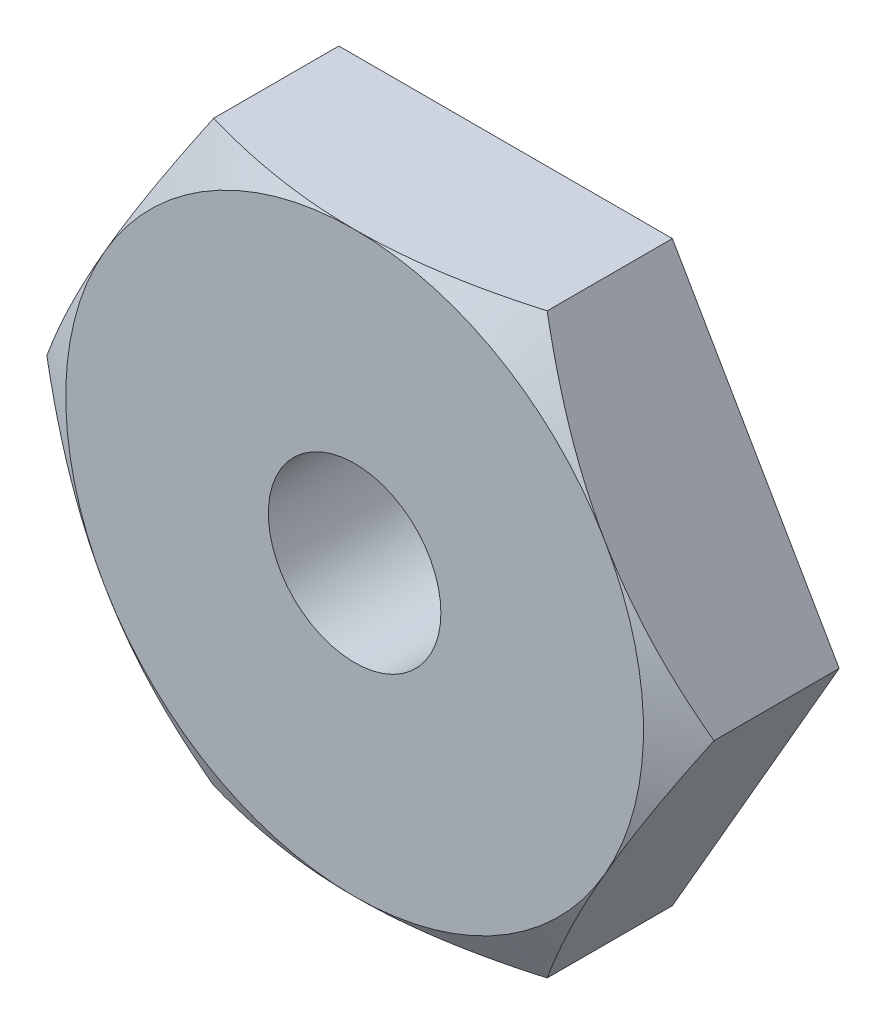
ISO-10303-21;
HEADER;
FILE_DESCRIPTION(('STEP AP214'),'2;1');
FILE_NAME('part.step','',(''),(''),'','','');
FILE_SCHEMA(('AUTOMOTIVE_DESIGN { 1 0 10303 214 1 1 1 1 }'));
ENDSEC;
DATA;
#1=APPLICATION_CONTEXT('core data for automotive mechanical design processes');
#2=APPLICATION_PROTOCOL_DEFINITION('international standard','automotive_design',2000,#1);
#3=PRODUCT_CONTEXT('',#1,'mechanical');
#4=PRODUCT('Part','Part','',(#3));
#5=PRODUCT_RELATED_PRODUCT_CATEGORY('part','',(#4));
#6=PRODUCT_DEFINITION_FORMATION('','',#4);
#7=PRODUCT_DEFINITION_CONTEXT('part definition',#1,'design');
#8=PRODUCT_DEFINITION('design','',#6,#7);
#9=PRODUCT_DEFINITION_SHAPE('','',#8);
#10=(LENGTH_UNIT() NAMED_UNIT(*) SI_UNIT(.MILLI.,.METRE.));
#11=(NAMED_UNIT(*) PLANE_ANGLE_UNIT() SI_UNIT($,.RADIAN.));
#12=(NAMED_UNIT(*) SI_UNIT($,.STERADIAN.) SOLID_ANGLE_UNIT());
#13=UNCERTAINTY_MEASURE_WITH_UNIT(LENGTH_MEASURE(1.E-05),#10,'distance_accuracy_value','');
#14=(GEOMETRIC_REPRESENTATION_CONTEXT(3) GLOBAL_UNCERTAINTY_ASSIGNED_CONTEXT((#13)) GLOBAL_UNIT_ASSIGNED_CONTEXT((#10,
#11,#12)) REPRESENTATION_CONTEXT('',''));
#15=CARTESIAN_POINT('',(0.,0.,0.));
#16=DIRECTION('',(0.,0.,1.));
#17=DIRECTION('',(1.,0.,0.));
#18=AXIS2_PLACEMENT_3D('',#15,#16,#17);
#19=CARTESIAN_POINT('',(-2.74963065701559,4.7625,2.4892));
#20=DIRECTION('',(0.,0.,-1.));
#21=DIRECTION('',(-1.,0.,0.));
#22=AXIS2_PLACEMENT_3D('',#19,#20,#21);
#23=PLANE('',#22);
#24=CARTESIAN_POINT('',(0.,0.,2.4892));
#25=DIRECTION('',(0.,0.,1.));
#26=DIRECTION('',(1.,0.,0.));
#27=AXIS2_PLACEMENT_3D('',#24,#25,#26);
#28=CIRCLE('',#27,1.4224);
#29=CARTESIAN_POINT('',(1.4224,0.,2.4892));
#30=VERTEX_POINT('',#29);
#31=EDGE_CURVE('E181',#30,#30,#28,.T.);
#32=ORIENTED_EDGE('',*,*,#31,.F.);
#33=EDGE_LOOP('',(#32));
#34=FACE_BOUND('',#33,.T.);
#35=CARTESIAN_POINT('',(0.,0.,2.4892));
#36=DIRECTION('',(0.,0.,1.));
#37=DIRECTION('',(1.,0.,0.));
#38=AXIS2_PLACEMENT_3D('',#35,#36,#37);
#39=CIRCLE('',#38,4.7625);
#40=CARTESIAN_POINT('',(0.,4.7625,2.4892));
#41=VERTEX_POINT('',#40);
#42=CARTESIAN_POINT('',(-4.12444598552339,2.38124999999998,2.4892));
#43=VERTEX_POINT('',#42);
#44=EDGE_CURVE('E154',#41,#43,#39,.T.);
#45=ORIENTED_EDGE('',*,*,#44,.T.);
#46=CARTESIAN_POINT('',(-4.12444598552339,-2.38124999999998,2.4892));
#47=VERTEX_POINT('',#46);
#48=EDGE_CURVE('E350',#43,#47,#39,.T.);
#49=ORIENTED_EDGE('',*,*,#48,.T.);
#50=CARTESIAN_POINT('',(0.,-4.7625,2.4892));
#51=VERTEX_POINT('',#50);
#52=EDGE_CURVE('E358',#47,#51,#39,.T.);
#53=ORIENTED_EDGE('',*,*,#52,.T.);
#54=CARTESIAN_POINT('',(4.12444598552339,-2.38124999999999,2.4892));
#55=VERTEX_POINT('',#54);
#56=EDGE_CURVE('E54',#51,#55,#39,.T.);
#57=ORIENTED_EDGE('',*,*,#56,.T.);
#58=CARTESIAN_POINT('',(4.12444598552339,2.38124999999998,2.4892));
#59=VERTEX_POINT('',#58);
#60=EDGE_CURVE('E62',#55,#59,#39,.T.);
#61=ORIENTED_EDGE('',*,*,#60,.T.);
#62=EDGE_CURVE('E359',#59,#41,#39,.T.);
#63=ORIENTED_EDGE('',*,*,#62,.T.);
#64=EDGE_LOOP('',(#45,#49,#53,#57,#61,#63));
#65=FACE_BOUND('',#64,.T.);
#66=ADVANCED_FACE('F32',(#34,#65),#23,.F.);
#67=CARTESIAN_POINT('',(-5.49926131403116,0.,2.4892));
#68=DIRECTION('',(0.86602540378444,-0.499999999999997,0.));
#69=DIRECTION('',(0.499999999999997,0.86602540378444,0.));
#70=AXIS2_PLACEMENT_3D('',#67,#68,#69);
#71=PLANE('',#70);
#72=CARTESIAN_POINT('',(-2.74951518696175,4.7627,2.06376398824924));
#73=CARTESIAN_POINT('',(-2.8703530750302,4.55340263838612,2.13354638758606));
#74=CARTESIAN_POINT('',(-2.99222449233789,4.34231515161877,2.19701673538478));
#75=CARTESIAN_POINT('',(-3.23807763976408,3.91648500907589,2.30780480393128));
#76=CARTESIAN_POINT('',(-3.36206373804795,3.701734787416,2.35508333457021));
#77=CARTESIAN_POINT('',(-3.60851825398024,3.27486304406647,2.42866647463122));
#78=CARTESIAN_POINT('',(-3.73094828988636,3.06280800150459,2.45546120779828));
#79=CARTESIAN_POINT('',(-3.91502401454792,2.7439794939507,2.47948887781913));
#80=CARTESIAN_POINT('',(-3.97642458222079,2.63763059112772,2.48480535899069));
#81=CARTESIAN_POINT('',(-4.09928246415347,2.42483449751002,2.4899598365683));
#82=CARTESIAN_POINT('',(-4.16073977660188,2.31838730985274,2.4897980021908));
#83=CARTESIAN_POINT('',(-4.32911636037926,2.02675051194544,2.4818150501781));
#84=CARTESIAN_POINT('',(-4.43597984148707,1.84165753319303,2.46840757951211));
#85=CARTESIAN_POINT('',(-4.6489975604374,1.47270002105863,2.42589213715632));
#86=CARTESIAN_POINT('',(-4.75515104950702,1.28883678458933,2.39676963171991));
#87=CARTESIAN_POINT('',(-4.96859796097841,0.919135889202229,2.32397074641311));
#88=CARTESIAN_POINT('',(-5.07586444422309,0.733344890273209,2.27998588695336));
#89=CARTESIAN_POINT('',(-5.28879766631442,0.364533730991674,2.18015772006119));
#90=CARTESIAN_POINT('',(-5.39446713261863,0.181508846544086,2.12433786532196));
#91=CARTESIAN_POINT('',(-5.499376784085,-0.000200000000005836,2.06376398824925));
#92=B_SPLINE_CURVE_WITH_KNOTS('',3,(#72,#73,#74,#75,#76,#77,#78,#79,#80,#81,#82,#83,#84,#85,#86,
#87,#88,#89,#90,#91),.UNSPECIFIED.,.F.,.F.,(4,2,2,2,2,2,2,2,2,4),(0.,0.754910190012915,
1.51163483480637,2.24963134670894,2.61827336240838,2.98690399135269,3.62867423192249,
4.27103902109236,4.92765153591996,5.58297484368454),.UNSPECIFIED.);
#93=CARTESIAN_POINT('',(-2.74963065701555,4.7625,2.06383065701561));
#94=VERTEX_POINT('',#93);
#95=EDGE_CURVE('E151',#94,#43,#92,.T.);
#96=ORIENTED_EDGE('',*,*,#95,.F.);
#97=DIRECTION('',(0.,0.,-1.));
#98=VECTOR('',#97,1.);
#99=CARTESIAN_POINT('',(-2.74963065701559,4.7625,2.4892));
#100=LINE('',#99,#98);
#101=CARTESIAN_POINT('',(-2.74963065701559,4.7625,0.));
#102=VERTEX_POINT('',#101);
#103=EDGE_CURVE('E135',#94,#102,#100,.T.);
#104=ORIENTED_EDGE('',*,*,#103,.T.);
#105=DIRECTION('',(-0.499999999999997,-0.86602540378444,0.));
#106=VECTOR('',#105,1.);
#107=CARTESIAN_POINT('',(-5.49926131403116,0.,0.));
#108=LINE('',#107,#106);
#109=CARTESIAN_POINT('',(-5.49926131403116,0.,0.));
#110=VERTEX_POINT('',#109);
#111=EDGE_CURVE('E179',#102,#110,#108,.T.);
#112=ORIENTED_EDGE('',*,*,#111,.T.);
#113=DIRECTION('',(0.,0.,-1.));
#114=VECTOR('',#113,1.);
#115=CARTESIAN_POINT('',(-5.49926131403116,0.,2.4892));
#116=LINE('',#115,#114);
#117=CARTESIAN_POINT('',(-5.49926131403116,0.,2.06383065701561));
#118=VERTEX_POINT('',#117);
#119=EDGE_CURVE('E139',#118,#110,#116,.T.);
#120=ORIENTED_EDGE('',*,*,#119,.F.);
#121=EDGE_CURVE('E162',#43,#118,#92,.T.);
#122=ORIENTED_EDGE('',*,*,#121,.F.);
#123=EDGE_LOOP('',(#96,#104,#112,#120,#122));
#124=FACE_BOUND('',#123,.T.);
#125=ADVANCED_FACE('F34',(#124),#71,.F.);
#126=CARTESIAN_POINT('',(-2.74963065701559,-4.7625,2.4892));
#127=DIRECTION('',(0.86602540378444,0.499999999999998,0.));
#128=DIRECTION('',(-0.499999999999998,0.86602540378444,0.));
#129=AXIS2_PLACEMENT_3D('',#126,#127,#128);
#130=PLANE('',#129);
#131=CARTESIAN_POINT('',(-5.499376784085,0.000199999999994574,2.06376398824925));
#132=CARTESIAN_POINT('',(-5.37853889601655,-0.209097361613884,2.13354638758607));
#133=CARTESIAN_POINT('',(-5.25666747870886,-0.420184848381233,2.19701673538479));
#134=CARTESIAN_POINT('',(-5.01081433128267,-0.846014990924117,2.30780480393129));
#135=CARTESIAN_POINT('',(-4.8868282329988,-1.06076521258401,2.35508333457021));
#136=CARTESIAN_POINT('',(-4.64037371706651,-1.48763695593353,2.42866647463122));
#137=CARTESIAN_POINT('',(-4.51794368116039,-1.69969199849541,2.45546120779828));
#138=CARTESIAN_POINT('',(-4.33386795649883,-2.0185205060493,2.47948887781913));
#139=CARTESIAN_POINT('',(-4.27246738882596,-2.12486940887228,2.48480535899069));
#140=CARTESIAN_POINT('',(-4.14960950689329,-2.33766550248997,2.4899598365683));
#141=CARTESIAN_POINT('',(-4.08815219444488,-2.44411269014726,2.4897980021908));
#142=CARTESIAN_POINT('',(-3.9197756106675,-2.73574948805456,2.48181505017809));
#143=CARTESIAN_POINT('',(-3.81291212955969,-2.92084246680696,2.46840757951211));
#144=CARTESIAN_POINT('',(-3.59989441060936,-3.28979997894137,2.42589213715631));
#145=CARTESIAN_POINT('',(-3.49374092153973,-3.47366321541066,2.3967696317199));
#146=CARTESIAN_POINT('',(-3.28029401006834,-3.84336411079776,2.3239707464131));
#147=CARTESIAN_POINT('',(-3.17302752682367,-4.02915510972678,2.27998588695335));
#148=CARTESIAN_POINT('',(-2.96009430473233,-4.39796626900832,2.18015772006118));
#149=CARTESIAN_POINT('',(-2.85442483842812,-4.58099115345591,2.12433786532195));
#150=CARTESIAN_POINT('',(-2.74951518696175,-4.7627,2.06376398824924));
#151=B_SPLINE_CURVE_WITH_KNOTS('',3,(#131,#132,#133,#134,#135,#136,#137,#138,#139,#140,#141,
#142,#143,#144,#145,#146,#147,#148,#149,#150),.UNSPECIFIED.,.F.,.F.,(4,2,2,2,2,2,2,2,2,4),(0.,
0.754910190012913,1.51163483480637,2.24963134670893,2.61827336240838,2.98690399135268,
3.62867423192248,4.27103902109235,4.92765153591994,5.58297484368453),.UNSPECIFIED.);
#152=EDGE_CURVE('E190',#118,#47,#151,.T.);
#153=ORIENTED_EDGE('',*,*,#152,.F.);
#154=ORIENTED_EDGE('',*,*,#119,.T.);
#155=DIRECTION('',(0.499999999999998,-0.86602540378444,0.));
#156=VECTOR('',#155,1.);
#157=CARTESIAN_POINT('',(-2.74963065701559,-4.7625,0.));
#158=LINE('',#157,#156);
#159=CARTESIAN_POINT('',(-2.74963065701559,-4.7625,0.));
#160=VERTEX_POINT('',#159);
#161=EDGE_CURVE('E177',#110,#160,#158,.T.);
#162=ORIENTED_EDGE('',*,*,#161,.T.);
#163=DIRECTION('',(0.,0.,-1.));
#164=VECTOR('',#163,1.);
#165=CARTESIAN_POINT('',(-2.74963065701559,-4.7625,2.4892));
#166=LINE('',#165,#164);
#167=CARTESIAN_POINT('',(-2.74963065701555,-4.7625,2.06383065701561));
#168=VERTEX_POINT('',#167);
#169=EDGE_CURVE('E133',#168,#160,#166,.T.);
#170=ORIENTED_EDGE('',*,*,#169,.F.);
#171=EDGE_CURVE('E191',#47,#168,#151,.T.);
#172=ORIENTED_EDGE('',*,*,#171,.F.);
#173=EDGE_LOOP('',(#153,#154,#162,#170,#172));
#174=FACE_BOUND('',#173,.T.);
#175=ADVANCED_FACE('F230',(#174),#130,.F.);
#176=CARTESIAN_POINT('',(2.74963065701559,-4.7625,2.4892));
#177=DIRECTION('',(0.,1.,0.));
#178=DIRECTION('',(0.,0.,1.));
#179=AXIS2_PLACEMENT_3D('',#176,#177,#178);
#180=PLANE('',#179);
#181=CARTESIAN_POINT('',(-7.29242571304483,-4.7625,0.21021656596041));
#182=CARTESIAN_POINT('',(-7.08332503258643,-4.7625,0.311265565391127));
#183=CARTESIAN_POINT('',(-6.87372996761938,-4.7625,0.411310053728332));
#184=CARTESIAN_POINT('',(-6.45328375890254,-4.7625,0.608815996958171));
#185=CARTESIAN_POINT('',(-6.24243240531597,-4.7625,0.706277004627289));
#186=CARTESIAN_POINT('',(-5.81806730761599,-4.7625,0.898555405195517));
#187=CARTESIAN_POINT('',(-5.60454523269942,-4.7625,0.99335447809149));
#188=CARTESIAN_POINT('',(-5.1757461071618,-4.7625,1.17888077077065));
#189=CARTESIAN_POINT('',(-4.96046914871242,-4.7625,1.26960820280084));
#190=CARTESIAN_POINT('',(-4.52514542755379,-4.7625,1.44698563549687));
#191=CARTESIAN_POINT('',(-4.30507255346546,-4.7625,1.53357190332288));
#192=CARTESIAN_POINT('',(-3.86233085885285,-4.7625,1.6999629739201));
#193=CARTESIAN_POINT('',(-3.63966175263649,-4.7625,1.77976702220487));
#194=CARTESIAN_POINT('',(-3.19183146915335,-4.7625,1.93044956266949));
#195=CARTESIAN_POINT('',(-2.96667674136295,-4.7625,2.0013470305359));
#196=CARTESIAN_POINT('',(-2.51316408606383,-4.7625,2.13191306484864));
#197=CARTESIAN_POINT('',(-2.28480719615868,-4.7625,2.1915851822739));
#198=CARTESIAN_POINT('',(-1.82474524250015,-4.7625,2.2968066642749));
#199=CARTESIAN_POINT('',(-1.59303930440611,-4.7625,2.34235226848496));
#200=CARTESIAN_POINT('',(-1.12680140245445,-4.7625,2.41624273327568));
#201=CARTESIAN_POINT('',(-0.892269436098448,-4.7625,2.4445875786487));
#202=CARTESIAN_POINT('',(-0.54009824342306,-4.7625,2.47238723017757));
#203=CARTESIAN_POINT('',(-0.423010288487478,-4.7625,2.47920225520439));
#204=CARTESIAN_POINT('',(-0.188645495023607,-4.7625,2.48787083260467));
#205=CARTESIAN_POINT('',(-0.0713686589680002,-4.7625,2.48972444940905));
#206=CARTESIAN_POINT('',(0.163123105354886,-4.7625,2.48842040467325));
#207=CARTESIAN_POINT('',(0.280338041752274,-4.7625,2.48526415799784));
#208=CARTESIAN_POINT('',(0.514533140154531,-4.7625,2.47402042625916));
#209=CARTESIAN_POINT('',(0.631513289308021,-4.7625,2.46593267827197));
#210=CARTESIAN_POINT('',(0.915050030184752,-4.7625,2.44052110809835));
#211=CARTESIAN_POINT('',(1.08138937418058,-4.7625,2.4207254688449));
#212=CARTESIAN_POINT('',(1.41276151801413,-4.7625,2.37226600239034));
#213=CARTESIAN_POINT('',(1.57779414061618,-4.7625,2.34360099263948));
#214=CARTESIAN_POINT('',(2.07083902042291,-4.7625,2.24581689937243));
#215=CARTESIAN_POINT('',(2.39654516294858,-4.7625,2.16493434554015));
#216=CARTESIAN_POINT('',(2.88391142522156,-4.7625,2.0254322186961));
#217=CARTESIAN_POINT('',(3.0481136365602,-4.7625,1.97519062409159));
#218=CARTESIAN_POINT('',(3.37480455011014,-4.7625,1.86973613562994));
#219=CARTESIAN_POINT('',(3.53729434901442,-4.7625,1.81452667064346));
#220=CARTESIAN_POINT('',(3.85988055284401,-4.7625,1.70028509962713));
#221=CARTESIAN_POINT('',(4.01998528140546,-4.7625,1.6412762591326));
#222=CARTESIAN_POINT('',(4.33895253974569,-4.7625,1.51979507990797));
#223=CARTESIAN_POINT('',(4.4978145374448,-4.7625,1.45732134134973));
#224=CARTESIAN_POINT('',(4.6561021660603,-4.7625,1.39345708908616));
#225=B_SPLINE_CURVE_WITH_KNOTS('',3,(#181,#182,#183,#184,#185,#186,#187,#188,#189,#190,#191,
#192,#193,#194,#195,#196,#197,#198,#199,#200,#201,#202,#203,#204,#205,#206,#207,#208,#209,#210,
#211,#212,#213,#214,#215,#216,#217,#218,#219,#220,#221,#222,#223,#224),.UNSPECIFIED.,.F.,.F.,(4,
2,2,2,2,2,2,2,2,2,2,2,2,2,2,2,2,2,2,2,2,4),(0.,0.696720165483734,1.39356016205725,
2.09438789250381,2.79517904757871,3.50457374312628,4.21404725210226,4.92198260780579,
5.62969364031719,6.33759289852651,7.04549278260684,7.39726182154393,7.74902629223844,
8.10069143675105,8.45237533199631,8.95462912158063,9.45694990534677,10.4623513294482,
10.9774608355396,11.4922174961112,12.0040767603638,12.5161443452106),.UNSPECIFIED.);
#226=EDGE_CURVE('E226',#168,#51,#225,.T.);
#227=ORIENTED_EDGE('',*,*,#226,.F.);
#228=ORIENTED_EDGE('',*,*,#169,.T.);
#229=DIRECTION('',(1.,0.,0.));
#230=VECTOR('',#229,1.);
#231=CARTESIAN_POINT('',(2.74963065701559,-4.7625,0.));
#232=LINE('',#231,#230);
#233=CARTESIAN_POINT('',(2.74963065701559,-4.7625,0.));
#234=VERTEX_POINT('',#233);
#235=EDGE_CURVE('E174',#160,#234,#232,.T.);
#236=ORIENTED_EDGE('',*,*,#235,.T.);
#237=DIRECTION('',(0.,0.,-1.));
#238=VECTOR('',#237,1.);
#239=CARTESIAN_POINT('',(2.74963065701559,-4.7625,2.4892));
#240=LINE('',#239,#238);
#241=CARTESIAN_POINT('',(2.74963065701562,-4.76249999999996,2.06383065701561));
#242=VERTEX_POINT('',#241);
#243=EDGE_CURVE('E130',#242,#234,#240,.T.);
#244=ORIENTED_EDGE('',*,*,#243,.F.);
#245=EDGE_CURVE('E220',#51,#242,#225,.T.);
#246=ORIENTED_EDGE('',*,*,#245,.F.);
#247=EDGE_LOOP('',(#227,#228,#236,#244,#246));
#248=FACE_BOUND('',#247,.T.);
#249=ADVANCED_FACE('F227',(#248),#180,.F.);
#250=CARTESIAN_POINT('',(5.49926131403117,0.,2.4892));
#251=DIRECTION('',(-0.86602540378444,0.499999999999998,0.));
#252=DIRECTION('',(-0.499999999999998,-0.86602540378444,0.));
#253=AXIS2_PLACEMENT_3D('',#250,#251,#252);
#254=PLANE('',#253);
#255=CARTESIAN_POINT('',(2.74951518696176,-4.7627,2.06376398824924));
#256=CARTESIAN_POINT('',(2.87035307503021,-4.55340263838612,2.13354638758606));
#257=CARTESIAN_POINT('',(2.9922244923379,-4.34231515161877,2.19701673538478));
#258=CARTESIAN_POINT('',(3.23807763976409,-3.91648500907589,2.30780480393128));
#259=CARTESIAN_POINT('',(3.36206373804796,-3.701734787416,2.35508333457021));
#260=CARTESIAN_POINT('',(3.60851825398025,-3.27486304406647,2.42866647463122));
#261=CARTESIAN_POINT('',(3.73094828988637,-3.06280800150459,2.45546120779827));
#262=CARTESIAN_POINT('',(3.91502401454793,-2.7439794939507,2.47948887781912));
#263=CARTESIAN_POINT('',(3.9764245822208,-2.63763059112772,2.48480535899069));
#264=CARTESIAN_POINT('',(4.09928246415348,-2.42483449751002,2.4899598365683));
#265=CARTESIAN_POINT('',(4.16073977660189,-2.31838730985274,2.4897980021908));
#266=CARTESIAN_POINT('',(4.32911636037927,-2.02675051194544,2.48181505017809));
#267=CARTESIAN_POINT('',(4.43597984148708,-1.84165753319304,2.46840757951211));
#268=CARTESIAN_POINT('',(4.64899756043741,-1.47270002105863,2.42589213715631));
#269=CARTESIAN_POINT('',(4.75515104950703,-1.28883678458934,2.39676963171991));
#270=CARTESIAN_POINT('',(4.96859796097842,-0.919135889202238,2.32397074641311));
#271=CARTESIAN_POINT('',(5.0758644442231,-0.733344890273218,2.27998588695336));
#272=CARTESIAN_POINT('',(5.28879766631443,-0.364533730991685,2.18015772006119));
#273=CARTESIAN_POINT('',(5.39446713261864,-0.181508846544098,2.12433786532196));
#274=CARTESIAN_POINT('',(5.49937678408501,0.000199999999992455,2.06376398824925));
#275=B_SPLINE_CURVE_WITH_KNOTS('',3,(#255,#256,#257,#258,#259,#260,#261,#262,#263,#264,#265,
#266,#267,#268,#269,#270,#271,#272,#273,#274),.UNSPECIFIED.,.F.,.F.,(4,2,2,2,2,2,2,2,2,4),(0.,
0.754910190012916,1.51163483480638,2.24963134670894,2.61827336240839,2.98690399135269,
3.62867423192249,4.27103902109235,4.92765153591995,5.58297484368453),.UNSPECIFIED.);
#276=EDGE_CURVE('E116',#242,#55,#275,.T.);
#277=ORIENTED_EDGE('',*,*,#276,.F.);
#278=ORIENTED_EDGE('',*,*,#243,.T.);
#279=DIRECTION('',(0.499999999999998,0.86602540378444,0.));
#280=VECTOR('',#279,1.);
#281=CARTESIAN_POINT('',(5.49926131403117,0.,0.));
#282=LINE('',#281,#280);
#283=CARTESIAN_POINT('',(5.49926131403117,0.,0.));
#284=VERTEX_POINT('',#283);
#285=EDGE_CURVE('E128',#234,#284,#282,.T.);
#286=ORIENTED_EDGE('',*,*,#285,.T.);
#287=DIRECTION('',(0.,0.,-1.));
#288=VECTOR('',#287,1.);
#289=CARTESIAN_POINT('',(5.49926131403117,0.,2.4892));
#290=LINE('',#289,#288);
#291=CARTESIAN_POINT('',(5.49926131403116,0.,2.06383065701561));
#292=VERTEX_POINT('',#291);
#293=EDGE_CURVE('E121',#292,#284,#290,.T.);
#294=ORIENTED_EDGE('',*,*,#293,.F.);
#295=EDGE_CURVE('E108',#55,#292,#275,.T.);
#296=ORIENTED_EDGE('',*,*,#295,.F.);
#297=EDGE_LOOP('',(#277,#278,#286,#294,#296));
#298=FACE_BOUND('',#297,.T.);
#299=ADVANCED_FACE('F126',(#298),#254,.F.);
#300=CARTESIAN_POINT('',(2.74963065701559,4.7625,2.4892));
#301=DIRECTION('',(-0.86602540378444,-0.499999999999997,0.));
#302=DIRECTION('',(0.499999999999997,-0.86602540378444,0.));
#303=AXIS2_PLACEMENT_3D('',#300,#301,#302);
#304=PLANE('',#303);
#305=CARTESIAN_POINT('',(5.49937678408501,-0.000200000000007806,2.06376398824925));
#306=CARTESIAN_POINT('',(5.37853889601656,0.209097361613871,2.13354638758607));
#307=CARTESIAN_POINT('',(5.25666747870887,0.42018484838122,2.19701673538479));
#308=CARTESIAN_POINT('',(5.01081433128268,0.846014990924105,2.30780480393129));
#309=CARTESIAN_POINT('',(4.88682823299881,1.06076521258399,2.35508333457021));
#310=CARTESIAN_POINT('',(4.64037371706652,1.48763695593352,2.42866647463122));
#311=CARTESIAN_POINT('',(4.5179436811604,1.6996919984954,2.45546120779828));
#312=CARTESIAN_POINT('',(4.33386795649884,2.01852050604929,2.47948887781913));
#313=CARTESIAN_POINT('',(4.27246738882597,2.12486940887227,2.48480535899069));
#314=CARTESIAN_POINT('',(4.14960950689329,2.33766550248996,2.4899598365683));
#315=CARTESIAN_POINT('',(4.08815219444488,2.44411269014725,2.4897980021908));
#316=CARTESIAN_POINT('',(3.9197756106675,2.73574948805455,2.48181505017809));
#317=CARTESIAN_POINT('',(3.81291212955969,2.92084246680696,2.46840757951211));
#318=CARTESIAN_POINT('',(3.59989441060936,3.28979997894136,2.42589213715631));
#319=CARTESIAN_POINT('',(3.49374092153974,3.47366321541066,2.3967696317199));
#320=CARTESIAN_POINT('',(3.28029401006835,3.84336411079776,2.3239707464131));
#321=CARTESIAN_POINT('',(3.17302752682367,4.02915510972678,2.27998588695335));
#322=CARTESIAN_POINT('',(2.96009430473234,4.39796626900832,2.18015772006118));
#323=CARTESIAN_POINT('',(2.85442483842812,4.58099115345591,2.12433786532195));
#324=CARTESIAN_POINT('',(2.74951518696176,4.7627,2.06376398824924));
#325=B_SPLINE_CURVE_WITH_KNOTS('',3,(#305,#306,#307,#308,#309,#310,#311,#312,#313,#314,#315,
#316,#317,#318,#319,#320,#321,#322,#323,#324),.UNSPECIFIED.,.F.,.F.,(4,2,2,2,2,2,2,2,2,4),(0.,
0.754910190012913,1.51163483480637,2.24963134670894,2.61827336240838,2.98690399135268,
3.62867423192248,4.27103902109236,4.92765153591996,5.58297484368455),.UNSPECIFIED.);
#326=EDGE_CURVE('E111',#292,#59,#325,.T.);
#327=ORIENTED_EDGE('',*,*,#326,.F.);
#328=ORIENTED_EDGE('',*,*,#293,.T.);
#329=DIRECTION('',(-0.499999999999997,0.86602540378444,0.));
#330=VECTOR('',#329,1.);
#331=CARTESIAN_POINT('',(2.74963065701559,4.7625,0.));
#332=LINE('',#331,#330);
#333=CARTESIAN_POINT('',(2.74963065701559,4.7625,0.));
#334=VERTEX_POINT('',#333);
#335=EDGE_CURVE('E169',#284,#334,#332,.T.);
#336=ORIENTED_EDGE('',*,*,#335,.T.);
#337=DIRECTION('',(0.,0.,-1.));
#338=VECTOR('',#337,1.);
#339=CARTESIAN_POINT('',(2.74963065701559,4.7625,2.4892));
#340=LINE('',#339,#338);
#341=CARTESIAN_POINT('',(2.74963065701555,4.7625,2.06383065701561));
#342=VERTEX_POINT('',#341);
#343=EDGE_CURVE('E131',#342,#334,#340,.T.);
#344=ORIENTED_EDGE('',*,*,#343,.F.);
#345=EDGE_CURVE('E124',#59,#342,#325,.T.);
#346=ORIENTED_EDGE('',*,*,#345,.F.);
#347=EDGE_LOOP('',(#327,#328,#336,#344,#346));
#348=FACE_BOUND('',#347,.T.);
#349=ADVANCED_FACE('F119',(#348),#304,.F.);
#350=CARTESIAN_POINT('',(-2.74963065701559,4.7625,2.4892));
#351=DIRECTION('',(0.,-1.,0.));
#352=DIRECTION('',(0.,0.,-1.));
#353=AXIS2_PLACEMENT_3D('',#350,#351,#352);
#354=PLANE('',#353);
#355=CARTESIAN_POINT('',(-7.29242571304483,4.7625,0.210216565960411));
#356=CARTESIAN_POINT('',(-7.08332503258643,4.7625,0.311265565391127));
#357=CARTESIAN_POINT('',(-6.87372996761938,4.7625,0.411310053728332));
#358=CARTESIAN_POINT('',(-6.45328375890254,4.7625,0.608815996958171));
#359=CARTESIAN_POINT('',(-6.24243240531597,4.7625,0.706277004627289));
#360=CARTESIAN_POINT('',(-5.81806730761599,4.7625,0.898555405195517));
#361=CARTESIAN_POINT('',(-5.60454523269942,4.7625,0.993354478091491));
#362=CARTESIAN_POINT('',(-5.1757461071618,4.7625,1.17888077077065));
#363=CARTESIAN_POINT('',(-4.96046914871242,4.7625,1.26960820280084));
#364=CARTESIAN_POINT('',(-4.52514542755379,4.7625,1.44698563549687));
#365=CARTESIAN_POINT('',(-4.30507255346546,4.7625,1.53357190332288));
#366=CARTESIAN_POINT('',(-3.86233085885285,4.7625,1.6999629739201));
#367=CARTESIAN_POINT('',(-3.63966175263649,4.7625,1.77976702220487));
#368=CARTESIAN_POINT('',(-3.19183146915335,4.7625,1.93044956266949));
#369=CARTESIAN_POINT('',(-2.96667674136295,4.7625,2.0013470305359));
#370=CARTESIAN_POINT('',(-2.51316408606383,4.7625,2.13191306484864));
#371=CARTESIAN_POINT('',(-2.28480719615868,4.7625,2.1915851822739));
#372=CARTESIAN_POINT('',(-1.82474524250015,4.7625,2.2968066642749));
#373=CARTESIAN_POINT('',(-1.59303930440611,4.7625,2.34235226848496));
#374=CARTESIAN_POINT('',(-1.12680140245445,4.7625,2.41624273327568));
#375=CARTESIAN_POINT('',(-0.892269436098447,4.7625,2.4445875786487));
#376=CARTESIAN_POINT('',(-0.54009824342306,4.7625,2.47238723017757));
#377=CARTESIAN_POINT('',(-0.423010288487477,4.7625,2.47920225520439));
#378=CARTESIAN_POINT('',(-0.188645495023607,4.7625,2.48787083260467));
#379=CARTESIAN_POINT('',(-0.0713686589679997,4.7625,2.48972444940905));
#380=CARTESIAN_POINT('',(0.163123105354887,4.7625,2.48842040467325));
#381=CARTESIAN_POINT('',(0.280338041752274,4.7625,2.48526415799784));
#382=CARTESIAN_POINT('',(0.514533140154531,4.7625,2.47402042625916));
#383=CARTESIAN_POINT('',(0.631513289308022,4.7625,2.46593267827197));
#384=CARTESIAN_POINT('',(0.915050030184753,4.7625,2.44052110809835));
#385=CARTESIAN_POINT('',(1.08138937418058,4.7625,2.4207254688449));
#386=CARTESIAN_POINT('',(1.41276151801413,4.7625,2.37226600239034));
#387=CARTESIAN_POINT('',(1.57779414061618,4.7625,2.34360099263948));
#388=CARTESIAN_POINT('',(2.07083902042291,4.7625,2.24581689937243));
#389=CARTESIAN_POINT('',(2.39654516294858,4.7625,2.16493434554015));
#390=CARTESIAN_POINT('',(2.88391142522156,4.7625,2.0254322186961));
#391=CARTESIAN_POINT('',(3.0481136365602,4.7625,1.97519062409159));
#392=CARTESIAN_POINT('',(3.37480455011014,4.7625,1.86973613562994));
#393=CARTESIAN_POINT('',(3.53729434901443,4.7625,1.81452667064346));
#394=CARTESIAN_POINT('',(3.85988055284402,4.7625,1.70028509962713));
#395=CARTESIAN_POINT('',(4.01998528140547,4.7625,1.6412762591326));
#396=CARTESIAN_POINT('',(4.33895253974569,4.7625,1.51979507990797));
#397=CARTESIAN_POINT('',(4.4978145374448,4.7625,1.45732134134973));
#398=CARTESIAN_POINT('',(4.6561021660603,4.7625,1.39345708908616));
#399=B_SPLINE_CURVE_WITH_KNOTS('',3,(#355,#356,#357,#358,#359,#360,#361,#362,#363,#364,#365,
#366,#367,#368,#369,#370,#371,#372,#373,#374,#375,#376,#377,#378,#379,#380,#381,#382,#383,#384,
#385,#386,#387,#388,#389,#390,#391,#392,#393,#394,#395,#396,#397,#398),.UNSPECIFIED.,.F.,.F.,(4,
2,2,2,2,2,2,2,2,2,2,2,2,2,2,2,2,2,2,2,2,4),(0.,0.696720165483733,1.39356016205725,
2.09438789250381,2.79517904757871,3.50457374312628,4.21404725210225,4.92198260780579,
5.62969364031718,6.33759289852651,7.04549278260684,7.39726182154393,7.74902629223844,
8.10069143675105,8.4523753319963,8.95462912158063,9.45694990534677,10.4623513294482,
10.9774608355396,11.4922174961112,12.0040767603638,12.5161443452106),.UNSPECIFIED.);
#400=EDGE_CURVE('E11',#342,#41,#399,.F.);
#401=ORIENTED_EDGE('',*,*,#400,.F.);
#402=ORIENTED_EDGE('',*,*,#343,.T.);
#403=DIRECTION('',(-1.,0.,0.));
#404=VECTOR('',#403,1.);
#405=CARTESIAN_POINT('',(-2.74963065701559,4.7625,0.));
#406=LINE('',#405,#404);
#407=EDGE_CURVE('E167',#334,#102,#406,.T.);
#408=ORIENTED_EDGE('',*,*,#407,.T.);
#409=ORIENTED_EDGE('',*,*,#103,.F.);
#410=EDGE_CURVE('E37',#41,#94,#399,.F.);
#411=ORIENTED_EDGE('',*,*,#410,.F.);
#412=EDGE_LOOP('',(#401,#402,#408,#409,#411));
#413=FACE_BOUND('',#412,.T.);
#414=ADVANCED_FACE('F165',(#413),#354,.F.);
#415=CARTESIAN_POINT('',(-2.74963065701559,4.7625,0.));
#416=DIRECTION('',(0.,0.,-1.));
#417=DIRECTION('',(-1.,0.,0.));
#418=AXIS2_PLACEMENT_3D('',#415,#416,#417);
#419=PLANE('',#418);
#420=ORIENTED_EDGE('',*,*,#111,.F.);
#421=ORIENTED_EDGE('',*,*,#407,.F.);
#422=ORIENTED_EDGE('',*,*,#335,.F.);
#423=ORIENTED_EDGE('',*,*,#285,.F.);
#424=ORIENTED_EDGE('',*,*,#235,.F.);
#425=ORIENTED_EDGE('',*,*,#161,.F.);
#426=EDGE_LOOP('',(#420,#421,#422,#423,#424,#425));
#427=FACE_BOUND('',#426,.T.);
#428=CARTESIAN_POINT('',(0.,0.,0.));
#429=DIRECTION('',(0.,0.,1.));
#430=DIRECTION('',(1.,0.,0.));
#431=AXIS2_PLACEMENT_3D('',#428,#429,#430);
#432=CIRCLE('',#431,1.4224);
#433=CARTESIAN_POINT('',(1.4224,0.,0.));
#434=VERTEX_POINT('',#433);
#435=EDGE_CURVE('E163',#434,#434,#432,.T.);
#436=ORIENTED_EDGE('',*,*,#435,.T.);
#437=EDGE_LOOP('',(#436));
#438=FACE_BOUND('',#437,.T.);
#439=ADVANCED_FACE('F245',(#427,#438),#419,.T.);
#440=CARTESIAN_POINT('',(0.,0.,2.4892));
#441=DIRECTION('',(0.,0.,-1.));
#442=DIRECTION('',(-1.,0.,0.));
#443=AXIS2_PLACEMENT_3D('',#440,#441,#442);
#444=CYLINDRICAL_SURFACE('',#443,1.4224);
#445=ORIENTED_EDGE('',*,*,#31,.T.);
#446=EDGE_LOOP('',(#445));
#447=FACE_BOUND('',#446,.T.);
#448=ORIENTED_EDGE('',*,*,#435,.F.);
#449=EDGE_LOOP('',(#448));
#450=FACE_BOUND('',#449,.T.);
#451=ADVANCED_FACE('F201',(#447,#450),#444,.F.);
#452=CARTESIAN_POINT('',(0.,0.,2.4892));
#453=DIRECTION('',(0.,0.,-1.));
#454=DIRECTION('',(-1.,0.,0.));
#455=AXIS2_PLACEMENT_3D('',#452,#453,#454);
#456=CONICAL_SURFACE('',#455,4.7625,1.04719755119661);
#457=ORIENTED_EDGE('',*,*,#95,.T.);
#458=ORIENTED_EDGE('',*,*,#44,.F.);
#459=ORIENTED_EDGE('',*,*,#410,.T.);
#460=EDGE_LOOP('',(#457,#458,#459));
#461=FACE_BOUND('',#460,.T.);
#462=ADVANCED_FACE('F150',(#461),#456,.T.);
#463=ORIENTED_EDGE('',*,*,#345,.T.);
#464=ORIENTED_EDGE('',*,*,#400,.T.);
#465=ORIENTED_EDGE('',*,*,#62,.F.);
#466=EDGE_LOOP('',(#463,#464,#465));
#467=FACE_BOUND('',#466,.T.);
#468=ADVANCED_FACE('F200',(#467),#456,.T.);
#469=ORIENTED_EDGE('',*,*,#295,.T.);
#470=ORIENTED_EDGE('',*,*,#326,.T.);
#471=ORIENTED_EDGE('',*,*,#60,.F.);
#472=EDGE_LOOP('',(#469,#470,#471));
#473=FACE_BOUND('',#472,.T.);
#474=ADVANCED_FACE('F110',(#473),#456,.T.);
#475=ORIENTED_EDGE('',*,*,#245,.T.);
#476=ORIENTED_EDGE('',*,*,#276,.T.);
#477=ORIENTED_EDGE('',*,*,#56,.F.);
#478=EDGE_LOOP('',(#475,#476,#477));
#479=FACE_BOUND('',#478,.T.);
#480=ADVANCED_FACE('F320',(#479),#456,.T.);
#481=ORIENTED_EDGE('',*,*,#171,.T.);
#482=ORIENTED_EDGE('',*,*,#226,.T.);
#483=ORIENTED_EDGE('',*,*,#52,.F.);
#484=EDGE_LOOP('',(#481,#482,#483));
#485=FACE_BOUND('',#484,.T.);
#486=ADVANCED_FACE('F328',(#485),#456,.T.);
#487=ORIENTED_EDGE('',*,*,#121,.T.);
#488=ORIENTED_EDGE('',*,*,#152,.T.);
#489=ORIENTED_EDGE('',*,*,#48,.F.);
#490=EDGE_LOOP('',(#487,#488,#489));
#491=FACE_BOUND('',#490,.T.);
#492=ADVANCED_FACE('F202',(#491),#456,.T.);
#493=CLOSED_SHELL('',(#66,#125,#175,#249,#299,#349,#414,#439,#451,#462,#468,#474,#480,#486,#492));
#494=MANIFOLD_SOLID_BREP('B2',#493);
#495=ADVANCED_BREP_SHAPE_REPRESENTATION('',(#18,#494),#14);
#496=SHAPE_DEFINITION_REPRESENTATION(#9,#495);
ENDSEC;
END-ISO-10303-21;
